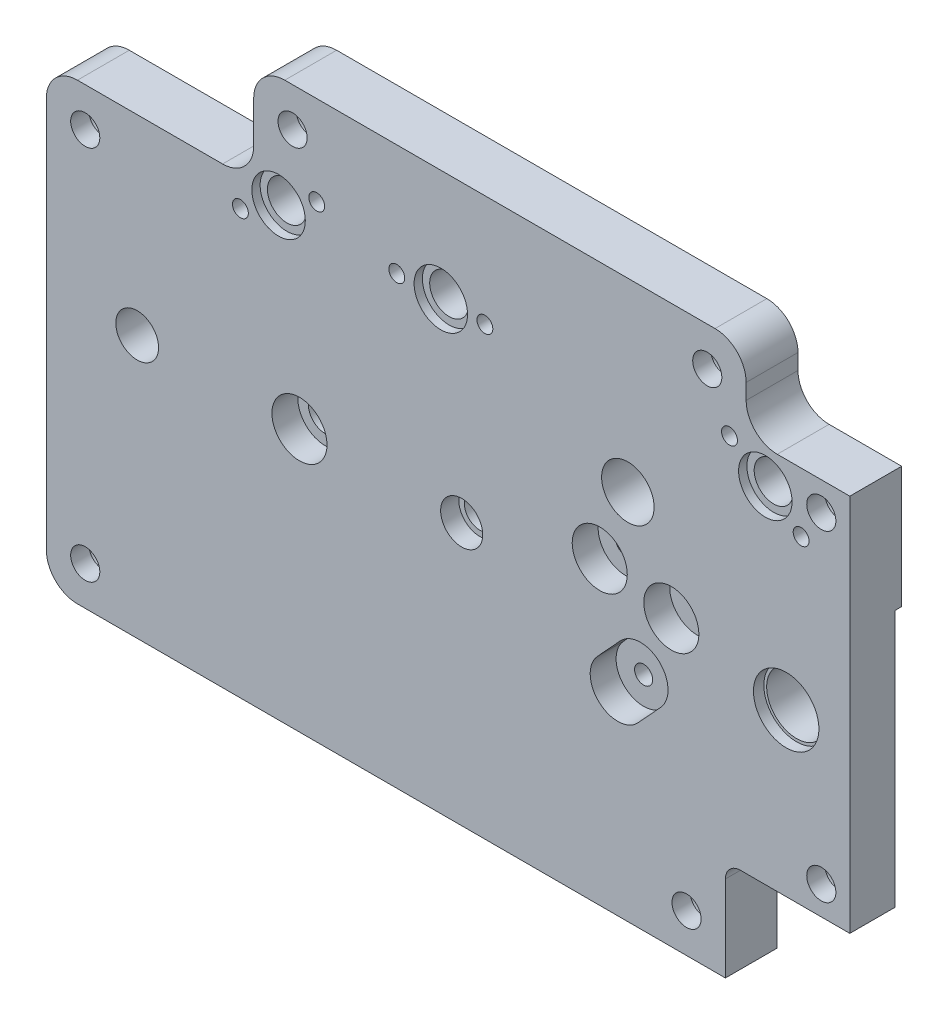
from build123d import *

# Parameters (mm, degrees)
BOSS_EXTRUDE1_DEPTH          = 12.7
SKETCH2_W                    = 450.85
SKETCH2_H                    = 68.199
CUT_EXTRUDE1_DEPTH           = 948.206657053
HOLE11_AT_2_COUNT            = 2
HOLE11_AT_2_PITCH            = 8.238679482
HOLE14_D                     = 12.86002
HOLE14_DEPTH                 = 10.414
CUT_EXTRUDE2_DEPTH           = 948.197479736
CUT_EXTRUDE2_OTHER_WAY_DEPTH = 948.197479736
CUT_EXTRUDE2_OTHER_WAY_TAPER = 1
HOLE18_D                     = 9.525
HOLE18_CBORE_D               = 13.09624
HOLE18_CBORE_DEPTH           = 2.032
HOLE19_D                     = 10.48004
CUT_EXTRUDE3_DEPTH           = 948.226756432
HOLE110_D                    = 7.1374
HOLE110_CBORE_D              = 10.7188
HOLE110_CBORE_DEPTH          = 8.255
HOLE112_AT_2_COUNT           = 2
HOLE112_AT_2_PITCH           = 120.397821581
HOLE112_AT_3_COUNT           = 2
HOLE112_AT_3_PITCH           = 21.59
HOLE112_AT_4_COUNT           = 2
HOLE112_AT_4_PITCH           = 60.263621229
HOLE112_AT_5_COUNT           = 2
HOLE112_AT_5_PITCH           = 101.135587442
HOLE112_AT_6_COUNT           = 2
HOLE112_AT_6_PITCH           = 81.766735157
CUT_EXTRUDE4_DEPTH           = 6.35


with BuildPart() as part:
    # Sketch1 → Boss-Extrude1 (new body)
    with BuildSketch(Plane(origin=(0, 0, 3.2), x_dir=(-1, 0, 0), z_dir=(0, 0, -1))):
        with BuildLine():
            Line((778.51, 41.275), (883.92, 41.275))
            ThreePointArc((883.92, 41.275), (889.308153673, 39.043153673), (891.54, 33.655))
            Line((891.54, 33.655), (891.54, 23.495))
            ThreePointArc((891.54, 23.495), (893.771846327, 18.106846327), (899.16, 15.875))
            Line((899.16, 15.875), (934.72, 15.875))
            ThreePointArc((934.72, 15.875), (940.108153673, 13.643153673), (942.34, 8.255))
            Line((942.34, 8.255), (942.34, -87.63))
            ThreePointArc((942.34, -87.63), (940.108153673, -93.018153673), (934.72, -95.25))
            Line((934.72, -95.25), (745.49, -95.25))
            Line((745.49, -95.25), (745.49, 22.225))
            Line((745.49, 22.225), (763.27, 22.225))
            ThreePointArc((763.27, 22.225), (768.658153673, 24.456846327), (770.89, 29.845))
            Line((770.89, 29.845), (770.89, 33.655))
            ThreePointArc((770.89, 33.655), (773.121846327, 39.043153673), (778.51, 41.275))
        make_face()
    extrude(amount=-BOSS_EXTRUDE1_DEPTH)

    # Sketch2 → Cut-Extrude1 (cut, through all)
    with BuildSketch(Plane(origin=(0, 0, 4.799861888), x_dir=(-1, 0, 0), z_dir=(0, 0, -1))):
        with Locations((970.915, -41.667340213)):
            Rectangle(SKETCH2_W, SKETCH2_H)
    extrude(amount=CUT_EXTRUDE1_DEPTH, mode=Mode.SUBTRACT)

    # Profil_Sketch → Hole1 (revolve, cut)
    with BuildSketch(Plane(origin=(-761.078795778, -30.950406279, 15.9), x_dir=(0, -1, 0), z_dir=(1, 0, 0))):
        Polygon((0, 12.7), (7.32282, 12.7), (7.32282, 2.54), (8.01751, 2.54), (8.01751, -1), (0, -1), align=None)
    revolve(axis=Axis((-761.078795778, -30.950406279, 15.9), (0, 0, -1)), mode=Mode.SUBTRACT)

    # Profil_Sketch1 → Hole11 (revolve, cut)
    with BuildSketch(Plane(origin=(-802.354782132, -47.241255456, 15.9), x_dir=(0, -1, 0), z_dir=(1, 0, 0))):
        Polygon((0, 12.7), (2.21869, 12.7), (2.21869, 5.789348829), (6.746875, 3.175), (6.746875, -1), (0, -1), align=None)
    hole11 = revolve(axis=Axis((-802.354782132, -47.241255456, 15.9), (0, 0, -1)), mode=Mode.SUBTRACT)

    # Hole11 at 2: Hole11 ×2
    with Locations(*[Vector(0.6769023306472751, 0.7360728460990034, 0) * (i * HOLE11_AT_2_PITCH) for i in range(1, HOLE11_AT_2_COUNT)]):
        add(hole11, mode=Mode.SUBTRACT)

    # Profil_Sketch2 → Hole12 (revolve, cut)
    with BuildSketch(Plane(origin=(-789.220778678, -25.553213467, 15.9), x_dir=(0, -1, 0), z_dir=(1, 0, 0))):
        Polygon((0, 12.7), (1.6677132, 12.7), (1.6677132, 6.35), (6.746875, 6.35), (6.746875, -1), (0, -1), align=None)
    revolve(axis=Axis((-789.220778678, -25.553213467, 15.9), (0, 0, -1)), mode=Mode.SUBTRACT)

    # Profil_Sketch3 → Hole13 (revolve, cut)
    with BuildSketch(Plane(origin=(-806.760388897, -21.686062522, 15.9), x_dir=(0, -1, 0), z_dir=(1, 0, 0))):
        Polygon((0, 12.7), (2.51841, 12.7), (2.51841, 6.35), (6.746875, 6.35), (6.746875, -1), (0, -1), align=None)
    revolve(axis=Axis((-806.760388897, -21.686062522, 15.9), (0, 0, -1)), mode=Mode.SUBTRACT)

    # Hole14
    with Locations(Plane(origin=(-803.527406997, 6.49142751, 15.9), x_dir=(1, 0, 0), z_dir=(0, 0, 1))):
        with Locations((3.654260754, -10.601140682)):
            Hole(HOLE14_D / 2, depth=HOLE14_DEPTH)

    # Sketch11 → Cut-Extrude2 (cut)
    with BuildSketch(Plane.XY.offset(5.612749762)):
        with BuildLine():
            Line((-798.729858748, -5.689887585), (-797.922938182, -4.137025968))
            ThreePointArc((-797.922938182, -4.137025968), (-798.665942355, -1.786534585), (-801.016433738, -2.529538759))
            Line((-801.016433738, -2.529538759), (-801.823354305, -4.082400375))
            ThreePointArc((-801.823354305, -4.082400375), (-801.080350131, -6.432891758), (-798.729858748, -5.689887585))
        make_face()
    extrude(amount=-CUT_EXTRUDE2_DEPTH, mode=Mode.SUBTRACT)

    # Sketch11 → Cut-Extrude2 other way (cut)
    with BuildSketch(Plane.XY.offset(5.612749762)):
        with BuildLine():
            Line((-798.729858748, -5.689887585), (-797.922938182, -4.137025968))
            ThreePointArc((-797.922938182, -4.137025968), (-798.665942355, -1.786534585), (-801.016433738, -2.529538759))
            Line((-801.016433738, -2.529538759), (-801.823354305, -4.082400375))
            ThreePointArc((-801.823354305, -4.082400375), (-801.080350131, -6.432891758), (-798.729858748, -5.689887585))
        make_face()
    extrude(amount=CUT_EXTRUDE2_OTHER_WAY_DEPTH, taper=CUT_EXTRUDE2_OTHER_WAY_TAPER, mode=Mode.SUBTRACT)

    # Profil_Sketch5 → Hole16 (revolve, cut)
    with BuildSketch(Plane(origin=(-880.331795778, -30.950406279, 15.9), x_dir=(0, -1, 0), z_dir=(1, 0, 0))):
        Polygon((0, 12.7), (4.18338, 12.7), (4.18338, 6.35), (6.746875, 6.35), (6.746875, -1), (0, -1), align=None)
    revolve(axis=Axis((-880.331795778, -30.950406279, 15.9), (0, 0, -1)), mode=Mode.SUBTRACT)

    # Profil_Sketch6 → Hole17 (revolve, cut)
    with BuildSketch(Plane(origin=(-840.580795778, -30.950406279, 15.9), x_dir=(0, -1, 0), z_dir=(1, 0, 0))):
        Polygon((0, 12.7), (3.80238, 12.7), (3.80238, 4.445), (5.159375, 4.445), (5.159375, -1), (0, -1), align=None)
    revolve(axis=Axis((-840.580795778, -30.950406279, 15.9), (0, 0, -1)), mode=Mode.SUBTRACT)

    # Hole18 (through all)
    with Locations(Plane(origin=(-779.060107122, 14.904999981, 15.9), x_dir=(1, 0, 0), z_dir=(0, 0, 1))):
        with Locations((12.869107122, -0.934999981), (-66.632892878, -0.934999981), (-106.383892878, -0.934999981)):
            CounterBoreHole(HOLE18_D / 2, HOLE18_CBORE_D / 2, HOLE18_CBORE_DEPTH)

    # Hole19 (through all)
    with Locations(Plane(origin=(-916.428535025, -20.349265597, 4.799861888), x_dir=(-1, 0, 0), z_dir=(0, 0, -1))):
        with Locations((3.654260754, -10.601140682)):
            Hole(HOLE19_D / 2)

    # Sketch12 → Cut-Extrude3 (cut, through all)
    with BuildSketch(Plane.XY.offset(15.9)):
        with BuildLine():
            Line((-1148.715, -74.231478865), (-1148.715, -101.790478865))
            ThreePointArc((-1148.715, -101.790478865), (-1147.636274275, -104.39475314), (-1145.032, -105.473478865))
            Line((-1145.032, -105.473478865), (-968.248, -105.473478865))
            ThreePointArc((-968.248, -105.473478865), (-965.643725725, -104.39475314), (-964.565, -101.790478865))
            Line((-964.565, -101.790478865), (-964.565, -74.231478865))
            ThreePointArc((-964.565, -74.231478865), (-965.643725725, -71.62720459), (-968.248, -70.548478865))
            Line((-968.248, -70.548478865), (-1145.032, -70.548478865))
            ThreePointArc((-1145.032, -70.548478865), (-1147.636274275, -71.62720459), (-1148.715, -74.231478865))
        make_face()
        with BuildLine():
            Line((-775.97, -74.231478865), (-775.97, -101.790478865))
            ThreePointArc((-775.97, -101.790478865), (-774.891274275, -104.39475314), (-772.287, -105.473478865))
            Line((-772.287, -105.473478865), (-706.12, -105.473478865))
            Line((-706.12, -105.473478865), (-706.12, -78.758350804))
            Line((-706.12, -78.758350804), (-714.329871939, -70.548478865))
            Line((-714.329871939, -70.548478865), (-772.287, -70.548478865))
            ThreePointArc((-772.287, -70.548478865), (-774.891274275, -71.62720459), (-775.97, -74.231478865))
        make_face()
    extrude(amount=-CUT_EXTRUDE3_DEPTH, mode=Mode.SUBTRACT)

    # Hole110 (through all)
    with Locations(Plane(origin=(-919.945892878, 7.284999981, 3.2), x_dir=(-1, 0, 0), z_dir=(0, 0, -1))):
        with Locations((12.869107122, -0.934999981), (-37.930892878, 24.465000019), (-139.530892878, 24.465000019), (-134.450892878, -93.009999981), (12.869107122, -93.009999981), (-167.470892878, 7.955000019), (-167.470892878, -70.848478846)):
            CounterBoreHole(HOLE110_D / 2, HOLE110_CBORE_D / 2, HOLE110_CBORE_DEPTH)

    # Profil_Sketch10 → Hole112 (revolve, cut)
    with BuildSketch(Plane(origin=(-774.96361291, 20.260730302, 15.9), x_dir=(0, -1, 0), z_dir=(1, 0, 0))):
        Polygon((0, 12.7), (0.79375, 12.7), (0.79375, 5.743577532), (1.9431, 5.08), (1.9431, -1), (0, -1), align=None)
    hole112 = revolve(axis=Axis((-774.96361291, 20.260730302, 15.9), (0, 0, -1)), mode=Mode.SUBTRACT)

    # Hole112 at 2: Hole112 ×2
    with Locations(*[Vector(-0.9952765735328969, -0.09708008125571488, 0) * (i * HOLE112_AT_2_PITCH) for i in range(1, HOLE112_AT_2_COUNT)]):
        add(hole112, mode=Mode.SUBTRACT)

    # Hole112 at 3: Hole112 ×2
    with Locations(*[Vector(0.8126552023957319, -0.582744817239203, 0) * (i * HOLE112_AT_3_PITCH) for i in range(1, HOLE112_AT_3_COUNT)]):
        add(hole112, mode=Mode.SUBTRACT)

    # Hole112 at 4: Hole112 ×2
    with Locations(*[Vector(-0.9945367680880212, -0.10438686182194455, 0) * (i * HOLE112_AT_4_PITCH) for i in range(1, HOLE112_AT_4_COUNT)]):
        add(hole112, mode=Mode.SUBTRACT)

    # Hole112 at 5: Hole112 ×2
    with Locations(*[Vector(-0.999960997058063, -0.008832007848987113, 0) * (i * HOLE112_AT_5_PITCH) for i in range(1, HOLE112_AT_5_COUNT)]):
        add(hole112, mode=Mode.SUBTRACT)

    # Hole112 at 6: Hole112 ×2
    with Locations(*[Vector(-0.9970361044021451, -0.07693507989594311, 0) * (i * HOLE112_AT_6_PITCH) for i in range(1, HOLE112_AT_6_COUNT)]):
        add(hole112, mode=Mode.SUBTRACT)

    # Sketch13 → Cut-Extrude4 (cut)
    with BuildSketch(Plane.XY.offset(15.9)):
        with BuildLine():
            Line((-807.320973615, -42.674280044), (-801.744192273, -36.61001179))
            ThreePointArc((-801.744192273, -36.61001179), (-792.211025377, -36.210795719), (-791.811809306, -45.743962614))
            Line((-791.811809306, -45.743962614), (-797.388590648, -51.808230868))
            ThreePointArc((-797.388590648, -51.808230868), (-806.921757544, -52.20744694), (-807.320973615, -42.674280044))
        make_face()
    extrude(amount=-CUT_EXTRUDE4_DEPTH, mode=Mode.SUBTRACT)


solid = part.part
